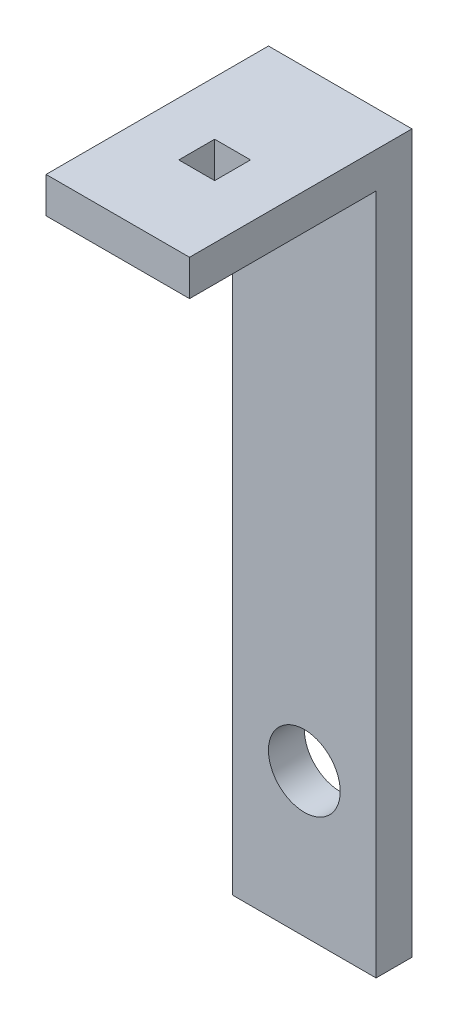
ISO-10303-21;
HEADER;
FILE_DESCRIPTION(('STEP AP214'),'2;1');
FILE_NAME('part.step','',(''),(''),'','','');
FILE_SCHEMA(('AUTOMOTIVE_DESIGN { 1 0 10303 214 1 1 1 1 }'));
ENDSEC;
DATA;
#1=APPLICATION_CONTEXT('core data for automotive mechanical design processes');
#2=APPLICATION_PROTOCOL_DEFINITION('international standard','automotive_design',2000,#1);
#3=PRODUCT_CONTEXT('',#1,'mechanical');
#4=PRODUCT('Part','Part','',(#3));
#5=PRODUCT_RELATED_PRODUCT_CATEGORY('part','',(#4));
#6=PRODUCT_DEFINITION_FORMATION('','',#4);
#7=PRODUCT_DEFINITION_CONTEXT('part definition',#1,'design');
#8=PRODUCT_DEFINITION('design','',#6,#7);
#9=PRODUCT_DEFINITION_SHAPE('','',#8);
#10=(LENGTH_UNIT() NAMED_UNIT(*) SI_UNIT(.MILLI.,.METRE.));
#11=(NAMED_UNIT(*) PLANE_ANGLE_UNIT() SI_UNIT($,.RADIAN.));
#12=(NAMED_UNIT(*) SI_UNIT($,.STERADIAN.) SOLID_ANGLE_UNIT());
#13=UNCERTAINTY_MEASURE_WITH_UNIT(LENGTH_MEASURE(1.E-05),#10,'distance_accuracy_value','');
#14=(GEOMETRIC_REPRESENTATION_CONTEXT(3) GLOBAL_UNCERTAINTY_ASSIGNED_CONTEXT((#13)) GLOBAL_UNIT_ASSIGNED_CONTEXT((#10,
#11,#12)) REPRESENTATION_CONTEXT('',''));
#15=CARTESIAN_POINT('',(0.,0.,0.));
#16=DIRECTION('',(0.,0.,1.));
#17=DIRECTION('',(1.,0.,0.));
#18=AXIS2_PLACEMENT_3D('',#15,#16,#17);
#19=CARTESIAN_POINT('',(20.,-5.,31.));
#20=DIRECTION('',(0.,1.,0.));
#21=DIRECTION('',(0.,0.,1.));
#22=AXIS2_PLACEMENT_3D('',#19,#20,#21);
#23=PLANE('',#22);
#24=DIRECTION('',(0.,0.,-1.));
#25=VECTOR('',#24,1.);
#26=CARTESIAN_POINT('',(0.,-5.,31.));
#27=LINE('',#26,#25);
#28=CARTESIAN_POINT('',(0.,-5.,31.));
#29=VERTEX_POINT('',#28);
#30=CARTESIAN_POINT('',(0.,-5.,5.));
#31=VERTEX_POINT('',#30);
#32=EDGE_CURVE('E152',#29,#31,#27,.T.);
#33=ORIENTED_EDGE('',*,*,#32,.T.);
#34=DIRECTION('',(-1.,0.,0.));
#35=VECTOR('',#34,1.);
#36=CARTESIAN_POINT('',(20.,-5.,5.));
#37=LINE('',#36,#35);
#38=CARTESIAN_POINT('',(20.,-5.,5.));
#39=VERTEX_POINT('',#38);
#40=EDGE_CURVE('E178',#39,#31,#37,.T.);
#41=ORIENTED_EDGE('',*,*,#40,.F.);
#42=DIRECTION('',(0.,0.,-1.));
#43=VECTOR('',#42,1.);
#44=CARTESIAN_POINT('',(20.,-5.,31.));
#45=LINE('',#44,#43);
#46=CARTESIAN_POINT('',(20.,-5.,31.));
#47=VERTEX_POINT('',#46);
#48=EDGE_CURVE('E137',#47,#39,#45,.T.);
#49=ORIENTED_EDGE('',*,*,#48,.F.);
#50=DIRECTION('',(-1.,0.,0.));
#51=VECTOR('',#50,1.);
#52=CARTESIAN_POINT('',(20.,-5.,31.));
#53=LINE('',#52,#51);
#54=EDGE_CURVE('E151',#47,#29,#53,.T.);
#55=ORIENTED_EDGE('',*,*,#54,.T.);
#56=EDGE_LOOP('',(#33,#41,#49,#55));
#57=FACE_BOUND('',#56,.T.);
#58=DIRECTION('',(0.,0.,1.));
#59=VECTOR('',#58,1.);
#60=CARTESIAN_POINT('',(7.5,-4.99999999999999,15.));
#61=LINE('',#60,#59);
#62=CARTESIAN_POINT('',(7.5,-5.,15.));
#63=VERTEX_POINT('',#62);
#64=CARTESIAN_POINT('',(7.5,-4.99999999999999,20.));
#65=VERTEX_POINT('',#64);
#66=EDGE_CURVE('E46',#63,#65,#61,.T.);
#67=ORIENTED_EDGE('',*,*,#66,.T.);
#68=DIRECTION('',(1.,0.,0.));
#69=VECTOR('',#68,1.);
#70=CARTESIAN_POINT('',(7.5,-4.99999999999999,20.));
#71=LINE('',#70,#69);
#72=CARTESIAN_POINT('',(12.5,-4.99999999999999,20.));
#73=VERTEX_POINT('',#72);
#74=EDGE_CURVE('E116',#65,#73,#71,.T.);
#75=ORIENTED_EDGE('',*,*,#74,.T.);
#76=DIRECTION('',(0.,0.,-1.));
#77=VECTOR('',#76,1.);
#78=CARTESIAN_POINT('',(12.5,-4.99999999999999,15.));
#79=LINE('',#78,#77);
#80=CARTESIAN_POINT('',(12.5,-4.99999999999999,15.));
#81=VERTEX_POINT('',#80);
#82=EDGE_CURVE('E122',#73,#81,#79,.T.);
#83=ORIENTED_EDGE('',*,*,#82,.T.);
#84=DIRECTION('',(-1.,0.,0.));
#85=VECTOR('',#84,1.);
#86=CARTESIAN_POINT('',(7.5,-4.99999999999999,15.));
#87=LINE('',#86,#85);
#88=EDGE_CURVE('E125',#81,#63,#87,.T.);
#89=ORIENTED_EDGE('',*,*,#88,.T.);
#90=EDGE_LOOP('',(#67,#75,#83,#89));
#91=FACE_BOUND('',#90,.T.);
#92=ADVANCED_FACE('F32',(#57,#91),#23,.F.);
#93=CARTESIAN_POINT('',(20.,0.,0.));
#94=DIRECTION('',(0.,-1.,0.));
#95=DIRECTION('',(0.,0.,-1.));
#96=AXIS2_PLACEMENT_3D('',#93,#94,#95);
#97=PLANE('',#96);
#98=DIRECTION('',(0.,0.,1.));
#99=VECTOR('',#98,1.);
#100=CARTESIAN_POINT('',(0.,0.,0.));
#101=LINE('',#100,#99);
#102=CARTESIAN_POINT('',(0.,0.,0.));
#103=VERTEX_POINT('',#102);
#104=CARTESIAN_POINT('',(0.,0.,31.));
#105=VERTEX_POINT('',#104);
#106=EDGE_CURVE('E161',#103,#105,#101,.T.);
#107=ORIENTED_EDGE('',*,*,#106,.T.);
#108=DIRECTION('',(-1.,0.,0.));
#109=VECTOR('',#108,1.);
#110=CARTESIAN_POINT('',(20.,0.,31.));
#111=LINE('',#110,#109);
#112=CARTESIAN_POINT('',(20.,0.,31.));
#113=VERTEX_POINT('',#112);
#114=EDGE_CURVE('E166',#113,#105,#111,.T.);
#115=ORIENTED_EDGE('',*,*,#114,.F.);
#116=DIRECTION('',(0.,0.,1.));
#117=VECTOR('',#116,1.);
#118=CARTESIAN_POINT('',(20.,0.,0.));
#119=LINE('',#118,#117);
#120=CARTESIAN_POINT('',(20.,0.,0.));
#121=VERTEX_POINT('',#120);
#122=EDGE_CURVE('E147',#121,#113,#119,.T.);
#123=ORIENTED_EDGE('',*,*,#122,.F.);
#124=DIRECTION('',(-1.,0.,0.));
#125=VECTOR('',#124,1.);
#126=CARTESIAN_POINT('',(20.,0.,0.));
#127=LINE('',#126,#125);
#128=EDGE_CURVE('E169',#121,#103,#127,.T.);
#129=ORIENTED_EDGE('',*,*,#128,.T.);
#130=EDGE_LOOP('',(#107,#115,#123,#129));
#131=FACE_BOUND('',#130,.T.);
#132=DIRECTION('',(0.,0.,1.));
#133=VECTOR('',#132,1.);
#134=CARTESIAN_POINT('',(7.5,0.,0.));
#135=LINE('',#134,#133);
#136=CARTESIAN_POINT('',(7.5,0.,15.));
#137=VERTEX_POINT('',#136);
#138=CARTESIAN_POINT('',(7.5,0.,20.));
#139=VERTEX_POINT('',#138);
#140=EDGE_CURVE('E11',#137,#139,#135,.T.);
#141=ORIENTED_EDGE('',*,*,#140,.F.);
#142=DIRECTION('',(-1.,0.,0.));
#143=VECTOR('',#142,1.);
#144=CARTESIAN_POINT('',(20.,0.,15.));
#145=LINE('',#144,#143);
#146=CARTESIAN_POINT('',(12.5,0.,15.));
#147=VERTEX_POINT('',#146);
#148=EDGE_CURVE('E181',#147,#137,#145,.T.);
#149=ORIENTED_EDGE('',*,*,#148,.F.);
#150=DIRECTION('',(0.,0.,-1.));
#151=VECTOR('',#150,1.);
#152=CARTESIAN_POINT('',(12.5,0.,0.));
#153=LINE('',#152,#151);
#154=CARTESIAN_POINT('',(12.5,0.,20.));
#155=VERTEX_POINT('',#154);
#156=EDGE_CURVE('E185',#155,#147,#153,.T.);
#157=ORIENTED_EDGE('',*,*,#156,.F.);
#158=DIRECTION('',(1.,0.,0.));
#159=VECTOR('',#158,1.);
#160=CARTESIAN_POINT('',(20.,0.,20.));
#161=LINE('',#160,#159);
#162=EDGE_CURVE('E39',#139,#155,#161,.T.);
#163=ORIENTED_EDGE('',*,*,#162,.F.);
#164=EDGE_LOOP('',(#141,#149,#157,#163));
#165=FACE_BOUND('',#164,.T.);
#166=ADVANCED_FACE('F191',(#131,#165),#97,.F.);
#167=CARTESIAN_POINT('',(20.,-100.,5.));
#168=DIRECTION('',(0.,0.,-1.));
#169=DIRECTION('',(-1.,0.,0.));
#170=AXIS2_PLACEMENT_3D('',#167,#168,#169);
#171=PLANE('',#170);
#172=DIRECTION('',(0.,-1.,0.));
#173=VECTOR('',#172,1.);
#174=CARTESIAN_POINT('',(0.,-100.,5.));
#175=LINE('',#174,#173);
#176=CARTESIAN_POINT('',(0.,-100.,5.));
#177=VERTEX_POINT('',#176);
#178=EDGE_CURVE('E155',#31,#177,#175,.T.);
#179=ORIENTED_EDGE('',*,*,#178,.T.);
#180=DIRECTION('',(-1.,0.,0.));
#181=VECTOR('',#180,1.);
#182=CARTESIAN_POINT('',(20.,-100.,5.));
#183=LINE('',#182,#181);
#184=CARTESIAN_POINT('',(20.,-100.,5.));
#185=VERTEX_POINT('',#184);
#186=EDGE_CURVE('E175',#185,#177,#183,.T.);
#187=ORIENTED_EDGE('',*,*,#186,.F.);
#188=DIRECTION('',(0.,-1.,0.));
#189=VECTOR('',#188,1.);
#190=CARTESIAN_POINT('',(20.,-100.,5.));
#191=LINE('',#190,#189);
#192=EDGE_CURVE('E140',#39,#185,#191,.T.);
#193=ORIENTED_EDGE('',*,*,#192,.F.);
#194=ORIENTED_EDGE('',*,*,#40,.T.);
#195=EDGE_LOOP('',(#179,#187,#193,#194));
#196=FACE_BOUND('',#195,.T.);
#197=CARTESIAN_POINT('',(10.,-80.,5.));
#198=DIRECTION('',(0.,0.,-1.));
#199=DIRECTION('',(-1.,0.,0.));
#200=AXIS2_PLACEMENT_3D('',#197,#198,#199);
#201=CIRCLE('',#200,5.);
#202=CARTESIAN_POINT('',(5.,-80.,5.));
#203=VERTEX_POINT('',#202);
#204=EDGE_CURVE('E112',#203,#203,#201,.T.);
#205=ORIENTED_EDGE('',*,*,#204,.T.);
#206=EDGE_LOOP('',(#205));
#207=FACE_BOUND('',#206,.T.);
#208=ADVANCED_FACE('F204',(#196,#207),#171,.F.);
#209=CARTESIAN_POINT('',(20.,0.,0.));
#210=DIRECTION('',(0.,0.,1.));
#211=DIRECTION('',(1.,0.,0.));
#212=AXIS2_PLACEMENT_3D('',#209,#210,#211);
#213=PLANE('',#212);
#214=DIRECTION('',(0.,1.,0.));
#215=VECTOR('',#214,1.);
#216=CARTESIAN_POINT('',(0.,0.,0.));
#217=LINE('',#216,#215);
#218=CARTESIAN_POINT('',(0.,-100.,0.));
#219=VERTEX_POINT('',#218);
#220=EDGE_CURVE('E159',#219,#103,#217,.T.);
#221=ORIENTED_EDGE('',*,*,#220,.T.);
#222=ORIENTED_EDGE('',*,*,#128,.F.);
#223=DIRECTION('',(0.,1.,0.));
#224=VECTOR('',#223,1.);
#225=CARTESIAN_POINT('',(20.,0.,0.));
#226=LINE('',#225,#224);
#227=CARTESIAN_POINT('',(20.,-100.,0.));
#228=VERTEX_POINT('',#227);
#229=EDGE_CURVE('E145',#228,#121,#226,.T.);
#230=ORIENTED_EDGE('',*,*,#229,.F.);
#231=DIRECTION('',(-1.,0.,0.));
#232=VECTOR('',#231,1.);
#233=CARTESIAN_POINT('',(20.,-100.,0.));
#234=LINE('',#233,#232);
#235=EDGE_CURVE('E172',#228,#219,#234,.T.);
#236=ORIENTED_EDGE('',*,*,#235,.T.);
#237=EDGE_LOOP('',(#221,#222,#230,#236));
#238=FACE_BOUND('',#237,.T.);
#239=CARTESIAN_POINT('',(10.,-80.,0.));
#240=DIRECTION('',(0.,0.,1.));
#241=DIRECTION('',(1.,0.,0.));
#242=AXIS2_PLACEMENT_3D('',#239,#240,#241);
#243=CIRCLE('',#242,5.);
#244=CARTESIAN_POINT('',(15.,-80.,0.));
#245=VERTEX_POINT('',#244);
#246=EDGE_CURVE('E136',#245,#245,#243,.F.);
#247=ORIENTED_EDGE('',*,*,#246,.F.);
#248=EDGE_LOOP('',(#247));
#249=FACE_BOUND('',#248,.T.);
#250=ADVANCED_FACE('F230',(#238,#249),#213,.F.);
#251=CARTESIAN_POINT('',(20.,-100.,0.));
#252=DIRECTION('',(0.,1.,0.));
#253=DIRECTION('',(0.,0.,1.));
#254=AXIS2_PLACEMENT_3D('',#251,#252,#253);
#255=PLANE('',#254);
#256=DIRECTION('',(0.,0.,-1.));
#257=VECTOR('',#256,1.);
#258=CARTESIAN_POINT('',(0.,-100.,0.));
#259=LINE('',#258,#257);
#260=EDGE_CURVE('E157',#177,#219,#259,.T.);
#261=ORIENTED_EDGE('',*,*,#260,.T.);
#262=ORIENTED_EDGE('',*,*,#235,.F.);
#263=DIRECTION('',(0.,0.,-1.));
#264=VECTOR('',#263,1.);
#265=CARTESIAN_POINT('',(20.,-100.,0.));
#266=LINE('',#265,#264);
#267=EDGE_CURVE('E143',#185,#228,#266,.T.);
#268=ORIENTED_EDGE('',*,*,#267,.F.);
#269=ORIENTED_EDGE('',*,*,#186,.T.);
#270=EDGE_LOOP('',(#261,#262,#268,#269));
#271=FACE_BOUND('',#270,.T.);
#272=ADVANCED_FACE('F235',(#271),#255,.F.);
#273=CARTESIAN_POINT('',(20.,0.,31.));
#274=DIRECTION('',(0.,0.,-1.));
#275=DIRECTION('',(-1.,0.,0.));
#276=AXIS2_PLACEMENT_3D('',#273,#274,#275);
#277=PLANE('',#276);
#278=DIRECTION('',(0.,-1.,0.));
#279=VECTOR('',#278,1.);
#280=CARTESIAN_POINT('',(0.,0.,31.));
#281=LINE('',#280,#279);
#282=EDGE_CURVE('E141',#105,#29,#281,.T.);
#283=ORIENTED_EDGE('',*,*,#282,.T.);
#284=ORIENTED_EDGE('',*,*,#54,.F.);
#285=DIRECTION('',(0.,-1.,0.));
#286=VECTOR('',#285,1.);
#287=CARTESIAN_POINT('',(20.,0.,31.));
#288=LINE('',#287,#286);
#289=EDGE_CURVE('E149',#113,#47,#288,.T.);
#290=ORIENTED_EDGE('',*,*,#289,.F.);
#291=ORIENTED_EDGE('',*,*,#114,.T.);
#292=EDGE_LOOP('',(#283,#284,#290,#291));
#293=FACE_BOUND('',#292,.T.);
#294=ADVANCED_FACE('F227',(#293),#277,.F.);
#295=CARTESIAN_POINT('',(20.,-5.,5.));
#296=DIRECTION('',(1.,0.,0.));
#297=DIRECTION('',(0.,0.,-1.));
#298=AXIS2_PLACEMENT_3D('',#295,#296,#297);
#299=PLANE('',#298);
#300=ORIENTED_EDGE('',*,*,#48,.T.);
#301=ORIENTED_EDGE('',*,*,#192,.T.);
#302=ORIENTED_EDGE('',*,*,#267,.T.);
#303=ORIENTED_EDGE('',*,*,#229,.T.);
#304=ORIENTED_EDGE('',*,*,#122,.T.);
#305=ORIENTED_EDGE('',*,*,#289,.T.);
#306=EDGE_LOOP('',(#300,#301,#302,#303,#304,#305));
#307=FACE_BOUND('',#306,.T.);
#308=ADVANCED_FACE('F222',(#307),#299,.T.);
#309=CARTESIAN_POINT('',(0.,-5.,5.));
#310=DIRECTION('',(1.,0.,0.));
#311=DIRECTION('',(0.,0.,-1.));
#312=AXIS2_PLACEMENT_3D('',#309,#310,#311);
#313=PLANE('',#312);
#314=ORIENTED_EDGE('',*,*,#32,.F.);
#315=ORIENTED_EDGE('',*,*,#282,.F.);
#316=ORIENTED_EDGE('',*,*,#106,.F.);
#317=ORIENTED_EDGE('',*,*,#220,.F.);
#318=ORIENTED_EDGE('',*,*,#260,.F.);
#319=ORIENTED_EDGE('',*,*,#178,.F.);
#320=EDGE_LOOP('',(#314,#315,#316,#317,#318,#319));
#321=FACE_BOUND('',#320,.T.);
#322=ADVANCED_FACE('F213',(#321),#313,.F.);
#323=CARTESIAN_POINT('',(10.,-80.,-15.));
#324=DIRECTION('',(0.,0.,1.));
#325=DIRECTION('',(1.,0.,0.));
#326=AXIS2_PLACEMENT_3D('',#323,#324,#325);
#327=CYLINDRICAL_SURFACE('',#326,5.);
#328=ORIENTED_EDGE('',*,*,#204,.F.);
#329=EDGE_LOOP('',(#328));
#330=FACE_BOUND('',#329,.T.);
#331=ORIENTED_EDGE('',*,*,#246,.T.);
#332=EDGE_LOOP('',(#331));
#333=FACE_BOUND('',#332,.T.);
#334=ADVANCED_FACE('F260',(#330,#333),#327,.F.);
#335=CARTESIAN_POINT('',(7.5,10.,15.));
#336=DIRECTION('',(1.,0.,0.));
#337=DIRECTION('',(0.,0.,-1.));
#338=AXIS2_PLACEMENT_3D('',#335,#336,#337);
#339=PLANE('',#338);
#340=ORIENTED_EDGE('',*,*,#140,.T.);
#341=DIRECTION('',(0.,-1.,0.));
#342=VECTOR('',#341,1.);
#343=CARTESIAN_POINT('',(7.5,10.,20.));
#344=LINE('',#343,#342);
#345=EDGE_CURVE('E106',#139,#65,#344,.T.);
#346=ORIENTED_EDGE('',*,*,#345,.T.);
#347=ORIENTED_EDGE('',*,*,#66,.F.);
#348=DIRECTION('',(0.,-1.,0.));
#349=VECTOR('',#348,1.);
#350=CARTESIAN_POINT('',(7.5,10.,15.));
#351=LINE('',#350,#349);
#352=EDGE_CURVE('E130',#137,#63,#351,.T.);
#353=ORIENTED_EDGE('',*,*,#352,.F.);
#354=EDGE_LOOP('',(#340,#346,#347,#353));
#355=FACE_BOUND('',#354,.T.);
#356=ADVANCED_FACE('F108',(#355),#339,.T.);
#357=CARTESIAN_POINT('',(7.5,10.,20.));
#358=DIRECTION('',(0.,0.,-1.));
#359=DIRECTION('',(0.,1.,0.));
#360=AXIS2_PLACEMENT_3D('',#357,#358,#359);
#361=PLANE('',#360);
#362=ORIENTED_EDGE('',*,*,#162,.T.);
#363=DIRECTION('',(0.,-1.,0.));
#364=VECTOR('',#363,1.);
#365=CARTESIAN_POINT('',(12.5,10.,20.));
#366=LINE('',#365,#364);
#367=EDGE_CURVE('E113',#155,#73,#366,.T.);
#368=ORIENTED_EDGE('',*,*,#367,.T.);
#369=ORIENTED_EDGE('',*,*,#74,.F.);
#370=ORIENTED_EDGE('',*,*,#345,.F.);
#371=EDGE_LOOP('',(#362,#368,#369,#370));
#372=FACE_BOUND('',#371,.T.);
#373=ADVANCED_FACE('F117',(#372),#361,.T.);
#374=CARTESIAN_POINT('',(12.5,10.,15.));
#375=DIRECTION('',(-1.,0.,0.));
#376=DIRECTION('',(0.,0.,1.));
#377=AXIS2_PLACEMENT_3D('',#374,#375,#376);
#378=PLANE('',#377);
#379=ORIENTED_EDGE('',*,*,#156,.T.);
#380=DIRECTION('',(0.,-1.,0.));
#381=VECTOR('',#380,1.);
#382=CARTESIAN_POINT('',(12.5,10.,15.));
#383=LINE('',#382,#381);
#384=EDGE_CURVE('E54',#147,#81,#383,.T.);
#385=ORIENTED_EDGE('',*,*,#384,.T.);
#386=ORIENTED_EDGE('',*,*,#82,.F.);
#387=ORIENTED_EDGE('',*,*,#367,.F.);
#388=EDGE_LOOP('',(#379,#385,#386,#387));
#389=FACE_BOUND('',#388,.T.);
#390=ADVANCED_FACE('F189',(#389),#378,.T.);
#391=CARTESIAN_POINT('',(7.5,10.,15.));
#392=DIRECTION('',(0.,0.,1.));
#393=DIRECTION('',(0.,-1.,0.));
#394=AXIS2_PLACEMENT_3D('',#391,#392,#393);
#395=PLANE('',#394);
#396=ORIENTED_EDGE('',*,*,#148,.T.);
#397=ORIENTED_EDGE('',*,*,#352,.T.);
#398=ORIENTED_EDGE('',*,*,#88,.F.);
#399=ORIENTED_EDGE('',*,*,#384,.F.);
#400=EDGE_LOOP('',(#396,#397,#398,#399));
#401=FACE_BOUND('',#400,.T.);
#402=ADVANCED_FACE('F192',(#401),#395,.T.);
#403=CLOSED_SHELL('',(#92,#166,#208,#250,#272,#294,#308,#322,#334,#356,#373,#390,#402));
#404=MANIFOLD_SOLID_BREP('B2',#403);
#405=ADVANCED_BREP_SHAPE_REPRESENTATION('',(#18,#404),#14);
#406=SHAPE_DEFINITION_REPRESENTATION(#9,#405);
ENDSEC;
END-ISO-10303-21;
